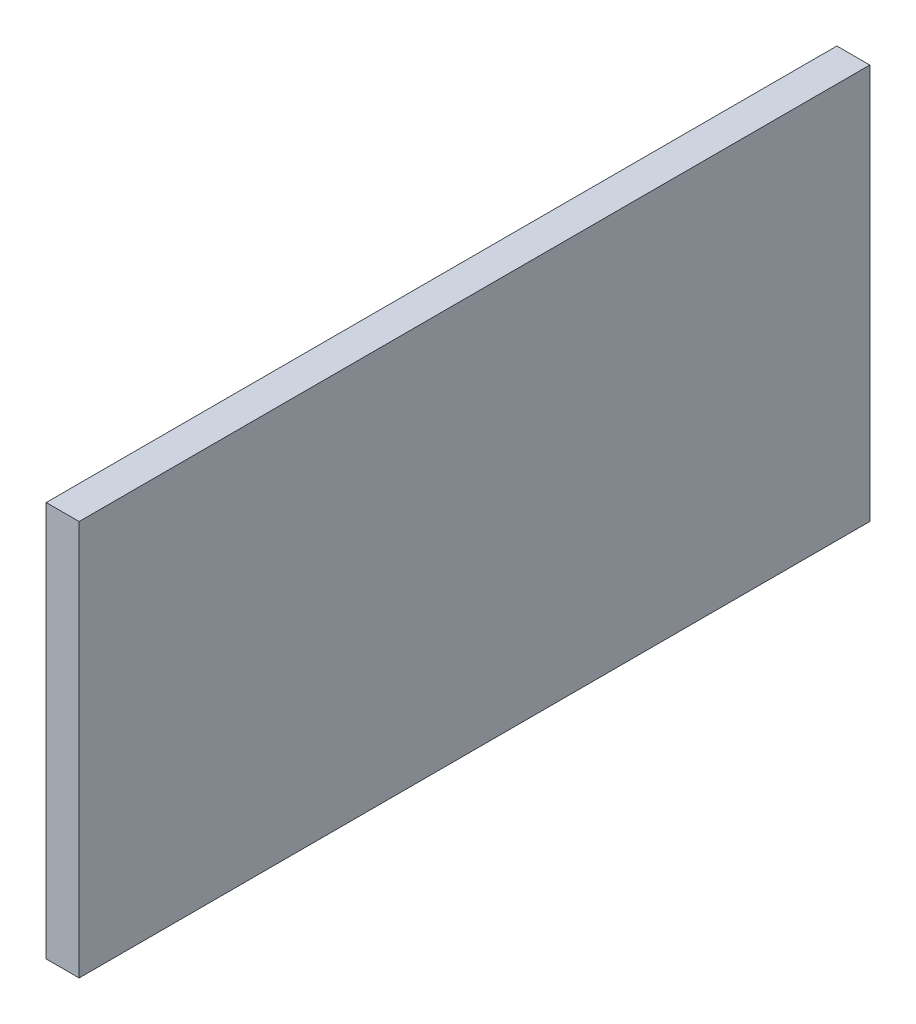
ISO-10303-21;
HEADER;
FILE_DESCRIPTION(('STEP AP214'),'2;1');
FILE_NAME('part.step','',(''),(''),'','','');
FILE_SCHEMA(('AUTOMOTIVE_DESIGN { 1 0 10303 214 1 1 1 1 }'));
ENDSEC;
DATA;
#1=APPLICATION_CONTEXT('core data for automotive mechanical design processes');
#2=APPLICATION_PROTOCOL_DEFINITION('international standard','automotive_design',2000,#1);
#3=PRODUCT_CONTEXT('',#1,'mechanical');
#4=PRODUCT('Part','Part','',(#3));
#5=PRODUCT_RELATED_PRODUCT_CATEGORY('part','',(#4));
#6=PRODUCT_DEFINITION_FORMATION('','',#4);
#7=PRODUCT_DEFINITION_CONTEXT('part definition',#1,'design');
#8=PRODUCT_DEFINITION('design','',#6,#7);
#9=PRODUCT_DEFINITION_SHAPE('','',#8);
#10=(LENGTH_UNIT() NAMED_UNIT(*) SI_UNIT(.MILLI.,.METRE.));
#11=(NAMED_UNIT(*) PLANE_ANGLE_UNIT() SI_UNIT($,.RADIAN.));
#12=(NAMED_UNIT(*) SI_UNIT($,.STERADIAN.) SOLID_ANGLE_UNIT());
#13=UNCERTAINTY_MEASURE_WITH_UNIT(LENGTH_MEASURE(1.E-05),#10,'distance_accuracy_value','');
#14=(GEOMETRIC_REPRESENTATION_CONTEXT(3) GLOBAL_UNCERTAINTY_ASSIGNED_CONTEXT((#13)) GLOBAL_UNIT_ASSIGNED_CONTEXT((#10,
#11,#12)) REPRESENTATION_CONTEXT('',''));
#15=CARTESIAN_POINT('',(0.,0.,0.));
#16=DIRECTION('',(0.,0.,1.));
#17=DIRECTION('',(1.,0.,0.));
#18=AXIS2_PLACEMENT_3D('',#15,#16,#17);
#19=CARTESIAN_POINT('',(0.,609.6,-1117.6));
#20=DIRECTION('',(1.,0.,0.));
#21=DIRECTION('',(0.,0.,-1.));
#22=AXIS2_PLACEMENT_3D('',#19,#20,#21);
#23=PLANE('',#22);
#24=DIRECTION('',(0.,0.,1.));
#25=VECTOR('',#24,1.);
#26=CARTESIAN_POINT('',(0.,193.04,-393.585401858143));
#27=LINE('',#26,#25);
#28=CARTESIAN_POINT('',(0.,193.04,-393.585401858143));
#29=VERTEX_POINT('',#28);
#30=CARTESIAN_POINT('',(0.,193.04,-317.385401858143));
#31=VERTEX_POINT('',#30);
#32=EDGE_CURVE('E156',#29,#31,#27,.T.);
#33=ORIENTED_EDGE('',*,*,#32,.F.);
#34=DIRECTION('',(0.,-1.,0.));
#35=VECTOR('',#34,1.);
#36=CARTESIAN_POINT('',(0.,266.7,-393.585401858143));
#37=LINE('',#36,#35);
#38=CARTESIAN_POINT('',(0.,266.7,-393.585401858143));
#39=VERTEX_POINT('',#38);
#40=EDGE_CURVE('E46',#39,#29,#37,.T.);
#41=ORIENTED_EDGE('',*,*,#40,.F.);
#42=DIRECTION('',(0.,0.,-1.));
#43=VECTOR('',#42,1.);
#44=CARTESIAN_POINT('',(0.,266.7,-393.585401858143));
#45=LINE('',#44,#43);
#46=CARTESIAN_POINT('',(0.,266.7,-317.385401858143));
#47=VERTEX_POINT('',#46);
#48=EDGE_CURVE('E147',#47,#39,#45,.T.);
#49=ORIENTED_EDGE('',*,*,#48,.F.);
#50=DIRECTION('',(0.,1.,0.));
#51=VECTOR('',#50,1.);
#52=CARTESIAN_POINT('',(0.,266.7,-317.385401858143));
#53=LINE('',#52,#51);
#54=EDGE_CURVE('E150',#31,#47,#53,.T.);
#55=ORIENTED_EDGE('',*,*,#54,.F.);
#56=EDGE_LOOP('',(#33,#41,#49,#55));
#57=FACE_BOUND('',#56,.T.);
#58=DIRECTION('',(0.,-1.,0.));
#59=VECTOR('',#58,1.);
#60=CARTESIAN_POINT('',(0.,609.6,0.));
#61=LINE('',#60,#59);
#62=CARTESIAN_POINT('',(0.,533.4,0.));
#63=VERTEX_POINT('',#62);
#64=CARTESIAN_POINT('',(0.,0.,0.));
#65=VERTEX_POINT('',#64);
#66=EDGE_CURVE('E11',#63,#65,#61,.T.);
#67=ORIENTED_EDGE('',*,*,#66,.F.);
#68=DIRECTION('',(0.,0.,1.));
#69=VECTOR('',#68,1.);
#70=CARTESIAN_POINT('',(0.,533.4,-1168.401));
#71=LINE('',#70,#69);
#72=CARTESIAN_POINT('',(0.,533.4,-1117.6));
#73=VERTEX_POINT('',#72);
#74=EDGE_CURVE('E168',#73,#63,#71,.T.);
#75=ORIENTED_EDGE('',*,*,#74,.F.);
#76=DIRECTION('',(0.,-1.,0.));
#77=VECTOR('',#76,1.);
#78=CARTESIAN_POINT('',(0.,609.6,-1117.6));
#79=LINE('',#78,#77);
#80=CARTESIAN_POINT('',(0.,0.,-1117.6));
#81=VERTEX_POINT('',#80);
#82=EDGE_CURVE('E89',#73,#81,#79,.T.);
#83=ORIENTED_EDGE('',*,*,#82,.T.);
#84=DIRECTION('',(0.,0.,1.));
#85=VECTOR('',#84,1.);
#86=CARTESIAN_POINT('',(0.,0.,-1117.6));
#87=LINE('',#86,#85);
#88=EDGE_CURVE('E174',#81,#65,#87,.T.);
#89=ORIENTED_EDGE('',*,*,#88,.T.);
#90=EDGE_LOOP('',(#67,#75,#83,#89));
#91=FACE_BOUND('',#90,.T.);
#92=ADVANCED_FACE('F32',(#57,#91),#23,.F.);
#93=CARTESIAN_POINT('',(0.,609.6,0.));
#94=DIRECTION('',(0.,0.,-1.));
#95=DIRECTION('',(-1.,0.,0.));
#96=AXIS2_PLACEMENT_3D('',#93,#94,#95);
#97=PLANE('',#96);
#98=DIRECTION('',(0.,-1.,0.));
#99=VECTOR('',#98,1.);
#100=CARTESIAN_POINT('',(50.8,609.6,0.));
#101=LINE('',#100,#99);
#102=CARTESIAN_POINT('',(50.8,533.4,0.));
#103=VERTEX_POINT('',#102);
#104=CARTESIAN_POINT('',(50.8,0.,0.));
#105=VERTEX_POINT('',#104);
#106=EDGE_CURVE('E39',#103,#105,#101,.T.);
#107=ORIENTED_EDGE('',*,*,#106,.F.);
#108=DIRECTION('',(1.,0.,0.));
#109=VECTOR('',#108,1.);
#110=CARTESIAN_POINT('',(0.,533.4,0.));
#111=LINE('',#110,#109);
#112=EDGE_CURVE('E162',#63,#103,#111,.T.);
#113=ORIENTED_EDGE('',*,*,#112,.F.);
#114=ORIENTED_EDGE('',*,*,#66,.T.);
#115=DIRECTION('',(1.,0.,0.));
#116=VECTOR('',#115,1.);
#117=CARTESIAN_POINT('',(0.,0.,0.));
#118=LINE('',#117,#116);
#119=EDGE_CURVE('E184',#65,#105,#118,.T.);
#120=ORIENTED_EDGE('',*,*,#119,.T.);
#121=EDGE_LOOP('',(#107,#113,#114,#120));
#122=FACE_BOUND('',#121,.T.);
#123=ADVANCED_FACE('F219',(#122),#97,.F.);
#124=CARTESIAN_POINT('',(50.8,609.6,50.8));
#125=DIRECTION('',(0.,0.,-1.));
#126=DIRECTION('',(-1.,0.,0.));
#127=AXIS2_PLACEMENT_3D('',#124,#125,#126);
#128=PLANE('',#127);
#129=DIRECTION('',(1.,0.,0.));
#130=VECTOR('',#129,1.);
#131=CARTESIAN_POINT('',(50.8,0.,50.8));
#132=LINE('',#131,#130);
#133=CARTESIAN_POINT('',(50.8,0.,50.8));
#134=VERTEX_POINT('',#133);
#135=CARTESIAN_POINT('',(101.6,0.,50.8));
#136=VERTEX_POINT('',#135);
#137=EDGE_CURVE('E189',#134,#136,#132,.T.);
#138=ORIENTED_EDGE('',*,*,#137,.T.);
#139=DIRECTION('',(0.,-1.,0.));
#140=VECTOR('',#139,1.);
#141=CARTESIAN_POINT('',(101.6,609.6,50.8));
#142=LINE('',#141,#140);
#143=CARTESIAN_POINT('',(101.6,609.6,50.8));
#144=VERTEX_POINT('',#143);
#145=EDGE_CURVE('E207',#144,#136,#142,.T.);
#146=ORIENTED_EDGE('',*,*,#145,.F.);
#147=DIRECTION('',(1.,0.,0.));
#148=VECTOR('',#147,1.);
#149=CARTESIAN_POINT('',(50.8,609.6,50.8));
#150=LINE('',#149,#148);
#151=CARTESIAN_POINT('',(50.8,609.6,50.8));
#152=VERTEX_POINT('',#151);
#153=EDGE_CURVE('E176',#152,#144,#150,.T.);
#154=ORIENTED_EDGE('',*,*,#153,.F.);
#155=DIRECTION('',(0.,-1.,0.));
#156=VECTOR('',#155,1.);
#157=CARTESIAN_POINT('',(50.8,609.6,50.8));
#158=LINE('',#157,#156);
#159=EDGE_CURVE('E210',#152,#134,#158,.T.);
#160=ORIENTED_EDGE('',*,*,#159,.T.);
#161=EDGE_LOOP('',(#138,#146,#154,#160));
#162=FACE_BOUND('',#161,.T.);
#163=ADVANCED_FACE('F229',(#162),#128,.F.);
#164=CARTESIAN_POINT('',(101.6,609.6,50.8));
#165=DIRECTION('',(-1.,0.,0.));
#166=DIRECTION('',(0.,0.,1.));
#167=AXIS2_PLACEMENT_3D('',#164,#165,#166);
#168=PLANE('',#167);
#169=DIRECTION('',(0.,0.,-1.));
#170=VECTOR('',#169,1.);
#171=CARTESIAN_POINT('',(101.6,0.,50.8));
#172=LINE('',#171,#170);
#173=CARTESIAN_POINT('',(101.6,0.,-1168.4));
#174=VERTEX_POINT('',#173);
#175=EDGE_CURVE('E191',#136,#174,#172,.T.);
#176=ORIENTED_EDGE('',*,*,#175,.T.);
#177=DIRECTION('',(0.,-1.,0.));
#178=VECTOR('',#177,1.);
#179=CARTESIAN_POINT('',(101.6,609.6,-1168.4));
#180=LINE('',#179,#178);
#181=CARTESIAN_POINT('',(101.6,609.6,-1168.4));
#182=VERTEX_POINT('',#181);
#183=EDGE_CURVE('E204',#182,#174,#180,.T.);
#184=ORIENTED_EDGE('',*,*,#183,.F.);
#185=DIRECTION('',(0.,0.,-1.));
#186=VECTOR('',#185,1.);
#187=CARTESIAN_POINT('',(101.6,609.6,50.8));
#188=LINE('',#187,#186);
#189=EDGE_CURVE('E179',#144,#182,#188,.T.);
#190=ORIENTED_EDGE('',*,*,#189,.F.);
#191=ORIENTED_EDGE('',*,*,#145,.T.);
#192=EDGE_LOOP('',(#176,#184,#190,#191));
#193=FACE_BOUND('',#192,.T.);
#194=ADVANCED_FACE('F233',(#193),#168,.F.);
#195=CARTESIAN_POINT('',(101.6,609.6,-1168.4));
#196=DIRECTION('',(0.,0.,1.));
#197=DIRECTION('',(1.,0.,0.));
#198=AXIS2_PLACEMENT_3D('',#195,#196,#197);
#199=PLANE('',#198);
#200=DIRECTION('',(-1.,0.,0.));
#201=VECTOR('',#200,1.);
#202=CARTESIAN_POINT('',(101.6,0.,-1168.4));
#203=LINE('',#202,#201);
#204=CARTESIAN_POINT('',(50.7999999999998,0.,-1168.4));
#205=VERTEX_POINT('',#204);
#206=EDGE_CURVE('E193',#174,#205,#203,.T.);
#207=ORIENTED_EDGE('',*,*,#206,.T.);
#208=DIRECTION('',(0.,-1.,0.));
#209=VECTOR('',#208,1.);
#210=CARTESIAN_POINT('',(50.7999999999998,609.6,-1168.4));
#211=LINE('',#210,#209);
#212=CARTESIAN_POINT('',(50.7999999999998,609.6,-1168.4));
#213=VERTEX_POINT('',#212);
#214=EDGE_CURVE('E202',#213,#205,#211,.T.);
#215=ORIENTED_EDGE('',*,*,#214,.F.);
#216=DIRECTION('',(-1.,0.,0.));
#217=VECTOR('',#216,1.);
#218=CARTESIAN_POINT('',(101.6,609.6,-1168.4));
#219=LINE('',#218,#217);
#220=EDGE_CURVE('E181',#182,#213,#219,.T.);
#221=ORIENTED_EDGE('',*,*,#220,.F.);
#222=ORIENTED_EDGE('',*,*,#183,.T.);
#223=EDGE_LOOP('',(#207,#215,#221,#222));
#224=FACE_BOUND('',#223,.T.);
#225=ADVANCED_FACE('F239',(#224),#199,.F.);
#226=CARTESIAN_POINT('',(50.7999999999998,609.6,-1168.4));
#227=DIRECTION('',(1.,0.,0.));
#228=DIRECTION('',(0.,0.,-1.));
#229=AXIS2_PLACEMENT_3D('',#226,#227,#228);
#230=PLANE('',#229);
#231=DIRECTION('',(0.,0.,1.));
#232=VECTOR('',#231,1.);
#233=CARTESIAN_POINT('',(50.7999999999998,0.,-1168.4));
#234=LINE('',#233,#232);
#235=CARTESIAN_POINT('',(50.7999999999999,0.,-1117.6));
#236=VERTEX_POINT('',#235);
#237=EDGE_CURVE('E195',#205,#236,#234,.T.);
#238=ORIENTED_EDGE('',*,*,#237,.T.);
#239=DIRECTION('',(0.,-1.,0.));
#240=VECTOR('',#239,1.);
#241=CARTESIAN_POINT('',(50.7999999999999,609.6,-1117.6));
#242=LINE('',#241,#240);
#243=CARTESIAN_POINT('',(50.8,533.4,-1117.6));
#244=VERTEX_POINT('',#243);
#245=EDGE_CURVE('E200',#244,#236,#242,.T.);
#246=ORIENTED_EDGE('',*,*,#245,.F.);
#247=DIRECTION('',(0.,0.,1.));
#248=VECTOR('',#247,1.);
#249=CARTESIAN_POINT('',(50.8,533.4,-1168.401));
#250=LINE('',#249,#248);
#251=EDGE_CURVE('E169',#244,#103,#250,.T.);
#252=ORIENTED_EDGE('',*,*,#251,.T.);
#253=ORIENTED_EDGE('',*,*,#106,.T.);
#254=DIRECTION('',(0.,0.,1.));
#255=VECTOR('',#254,1.);
#256=CARTESIAN_POINT('',(50.8,0.,0.));
#257=LINE('',#256,#255);
#258=EDGE_CURVE('E187',#105,#134,#257,.T.);
#259=ORIENTED_EDGE('',*,*,#258,.T.);
#260=ORIENTED_EDGE('',*,*,#159,.F.);
#261=DIRECTION('',(0.,0.,1.));
#262=VECTOR('',#261,1.);
#263=CARTESIAN_POINT('',(50.8,609.6,0.));
#264=LINE('',#263,#262);
#265=EDGE_CURVE('E55',#213,#152,#264,.T.);
#266=ORIENTED_EDGE('',*,*,#265,.F.);
#267=ORIENTED_EDGE('',*,*,#214,.T.);
#268=EDGE_LOOP('',(#238,#246,#252,#253,#259,#260,#266,#267));
#269=FACE_BOUND('',#268,.T.);
#270=ADVANCED_FACE('F213',(#269),#230,.F.);
#271=CARTESIAN_POINT('',(50.7999999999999,609.6,-1117.6));
#272=DIRECTION('',(0.,0.,1.));
#273=DIRECTION('',(1.,0.,0.));
#274=AXIS2_PLACEMENT_3D('',#271,#272,#273);
#275=PLANE('',#274);
#276=ORIENTED_EDGE('',*,*,#82,.F.);
#277=DIRECTION('',(-1.,0.,0.));
#278=VECTOR('',#277,1.);
#279=CARTESIAN_POINT('',(0.,533.4,-1117.6));
#280=LINE('',#279,#278);
#281=EDGE_CURVE('E171',#244,#73,#280,.T.);
#282=ORIENTED_EDGE('',*,*,#281,.F.);
#283=ORIENTED_EDGE('',*,*,#245,.T.);
#284=DIRECTION('',(-1.,0.,0.));
#285=VECTOR('',#284,1.);
#286=CARTESIAN_POINT('',(50.7999999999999,0.,-1117.6));
#287=LINE('',#286,#285);
#288=EDGE_CURVE('E177',#236,#81,#287,.T.);
#289=ORIENTED_EDGE('',*,*,#288,.T.);
#290=EDGE_LOOP('',(#276,#282,#283,#289));
#291=FACE_BOUND('',#290,.T.);
#292=ADVANCED_FACE('F243',(#291),#275,.F.);
#293=CARTESIAN_POINT('',(0.,609.6,0.));
#294=DIRECTION('',(0.,1.,0.));
#295=DIRECTION('',(0.,0.,1.));
#296=AXIS2_PLACEMENT_3D('',#293,#294,#295);
#297=PLANE('',#296);
#298=ORIENTED_EDGE('',*,*,#220,.T.);
#299=ORIENTED_EDGE('',*,*,#265,.T.);
#300=ORIENTED_EDGE('',*,*,#153,.T.);
#301=ORIENTED_EDGE('',*,*,#189,.T.);
#302=EDGE_LOOP('',(#298,#299,#300,#301));
#303=FACE_BOUND('',#302,.T.);
#304=ADVANCED_FACE('F236',(#303),#297,.T.);
#305=CARTESIAN_POINT('',(0.,0.,0.));
#306=DIRECTION('',(0.,1.,0.));
#307=DIRECTION('',(0.,0.,1.));
#308=AXIS2_PLACEMENT_3D('',#305,#306,#307);
#309=PLANE('',#308);
#310=ORIENTED_EDGE('',*,*,#88,.F.);
#311=ORIENTED_EDGE('',*,*,#288,.F.);
#312=ORIENTED_EDGE('',*,*,#237,.F.);
#313=ORIENTED_EDGE('',*,*,#206,.F.);
#314=ORIENTED_EDGE('',*,*,#175,.F.);
#315=ORIENTED_EDGE('',*,*,#137,.F.);
#316=ORIENTED_EDGE('',*,*,#258,.F.);
#317=ORIENTED_EDGE('',*,*,#119,.F.);
#318=EDGE_LOOP('',(#310,#311,#312,#313,#314,#315,#316,#317));
#319=FACE_BOUND('',#318,.T.);
#320=ADVANCED_FACE('F224',(#319),#309,.F.);
#321=CARTESIAN_POINT('',(0.,533.4,-1168.401));
#322=DIRECTION('',(0.,-1.,0.));
#323=DIRECTION('',(0.,0.,-1.));
#324=AXIS2_PLACEMENT_3D('',#321,#322,#323);
#325=PLANE('',#324);
#326=ORIENTED_EDGE('',*,*,#281,.T.);
#327=ORIENTED_EDGE('',*,*,#74,.T.);
#328=ORIENTED_EDGE('',*,*,#112,.T.);
#329=ORIENTED_EDGE('',*,*,#251,.F.);
#330=EDGE_LOOP('',(#326,#327,#328,#329));
#331=FACE_BOUND('',#330,.T.);
#332=ADVANCED_FACE('F246',(#331),#325,.F.);
#333=CARTESIAN_POINT('',(50.8,266.7,-393.585401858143));
#334=DIRECTION('',(0.,0.,-1.));
#335=DIRECTION('',(-1.,0.,0.));
#336=AXIS2_PLACEMENT_3D('',#333,#334,#335);
#337=PLANE('',#336);
#338=ORIENTED_EDGE('',*,*,#40,.T.);
#339=DIRECTION('',(-1.,0.,0.));
#340=VECTOR('',#339,1.);
#341=CARTESIAN_POINT('',(50.8,193.04,-393.585401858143));
#342=LINE('',#341,#340);
#343=CARTESIAN_POINT('',(50.8,193.04,-393.585401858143));
#344=VERTEX_POINT('',#343);
#345=EDGE_CURVE('E125',#344,#29,#342,.T.);
#346=ORIENTED_EDGE('',*,*,#345,.F.);
#347=DIRECTION('',(0.,-1.,0.));
#348=VECTOR('',#347,1.);
#349=CARTESIAN_POINT('',(50.8,266.7,-393.585401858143));
#350=LINE('',#349,#348);
#351=CARTESIAN_POINT('',(50.8,266.7,-393.585401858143));
#352=VERTEX_POINT('',#351);
#353=EDGE_CURVE('E129',#352,#344,#350,.T.);
#354=ORIENTED_EDGE('',*,*,#353,.F.);
#355=DIRECTION('',(-1.,0.,0.));
#356=VECTOR('',#355,1.);
#357=CARTESIAN_POINT('',(50.8,266.7,-393.585401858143));
#358=LINE('',#357,#356);
#359=EDGE_CURVE('E160',#352,#39,#358,.T.);
#360=ORIENTED_EDGE('',*,*,#359,.T.);
#361=EDGE_LOOP('',(#338,#346,#354,#360));
#362=FACE_BOUND('',#361,.T.);
#363=ADVANCED_FACE('F127',(#362),#337,.F.);
#364=CARTESIAN_POINT('',(50.8,266.7,-393.585401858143));
#365=DIRECTION('',(0.,1.,0.));
#366=DIRECTION('',(0.,0.,1.));
#367=AXIS2_PLACEMENT_3D('',#364,#365,#366);
#368=PLANE('',#367);
#369=ORIENTED_EDGE('',*,*,#48,.T.);
#370=ORIENTED_EDGE('',*,*,#359,.F.);
#371=DIRECTION('',(0.,0.,-1.));
#372=VECTOR('',#371,1.);
#373=CARTESIAN_POINT('',(50.8,266.7,-393.585401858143));
#374=LINE('',#373,#372);
#375=CARTESIAN_POINT('',(50.8,266.7,-317.385401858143));
#376=VERTEX_POINT('',#375);
#377=EDGE_CURVE('E135',#376,#352,#374,.T.);
#378=ORIENTED_EDGE('',*,*,#377,.F.);
#379=DIRECTION('',(-1.,0.,0.));
#380=VECTOR('',#379,1.);
#381=CARTESIAN_POINT('',(50.8,266.7,-317.385401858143));
#382=LINE('',#381,#380);
#383=EDGE_CURVE('E163',#376,#47,#382,.T.);
#384=ORIENTED_EDGE('',*,*,#383,.T.);
#385=EDGE_LOOP('',(#369,#370,#378,#384));
#386=FACE_BOUND('',#385,.T.);
#387=ADVANCED_FACE('F257',(#386),#368,.F.);
#388=CARTESIAN_POINT('',(50.8,266.7,-317.385401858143));
#389=DIRECTION('',(0.,0.,1.));
#390=DIRECTION('',(0.,-1.,0.));
#391=AXIS2_PLACEMENT_3D('',#388,#389,#390);
#392=PLANE('',#391);
#393=ORIENTED_EDGE('',*,*,#54,.T.);
#394=ORIENTED_EDGE('',*,*,#383,.F.);
#395=DIRECTION('',(0.,1.,0.));
#396=VECTOR('',#395,1.);
#397=CARTESIAN_POINT('',(50.8,266.7,-317.385401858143));
#398=LINE('',#397,#396);
#399=CARTESIAN_POINT('',(50.8,193.04,-317.385401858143));
#400=VERTEX_POINT('',#399);
#401=EDGE_CURVE('E143',#400,#376,#398,.T.);
#402=ORIENTED_EDGE('',*,*,#401,.F.);
#403=DIRECTION('',(-1.,0.,0.));
#404=VECTOR('',#403,1.);
#405=CARTESIAN_POINT('',(50.8,193.04,-317.385401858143));
#406=LINE('',#405,#404);
#407=EDGE_CURVE('E134',#400,#31,#406,.T.);
#408=ORIENTED_EDGE('',*,*,#407,.T.);
#409=EDGE_LOOP('',(#393,#394,#402,#408));
#410=FACE_BOUND('',#409,.T.);
#411=ADVANCED_FACE('F255',(#410),#392,.F.);
#412=CARTESIAN_POINT('',(50.8,193.04,-393.585401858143));
#413=DIRECTION('',(0.,-1.,0.));
#414=DIRECTION('',(0.,0.,-1.));
#415=AXIS2_PLACEMENT_3D('',#412,#413,#414);
#416=PLANE('',#415);
#417=ORIENTED_EDGE('',*,*,#32,.T.);
#418=ORIENTED_EDGE('',*,*,#407,.F.);
#419=DIRECTION('',(0.,0.,1.));
#420=VECTOR('',#419,1.);
#421=CARTESIAN_POINT('',(50.8,193.04,-393.585401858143));
#422=LINE('',#421,#420);
#423=EDGE_CURVE('E138',#344,#400,#422,.T.);
#424=ORIENTED_EDGE('',*,*,#423,.F.);
#425=ORIENTED_EDGE('',*,*,#345,.T.);
#426=EDGE_LOOP('',(#417,#418,#424,#425));
#427=FACE_BOUND('',#426,.T.);
#428=ADVANCED_FACE('F139',(#427),#416,.F.);
#429=CARTESIAN_POINT('',(50.8,0.,0.));
#430=DIRECTION('',(-1.,0.,0.));
#431=DIRECTION('',(0.,0.,1.));
#432=AXIS2_PLACEMENT_3D('',#429,#430,#431);
#433=PLANE('',#432);
#434=ORIENTED_EDGE('',*,*,#353,.T.);
#435=ORIENTED_EDGE('',*,*,#423,.T.);
#436=ORIENTED_EDGE('',*,*,#401,.T.);
#437=ORIENTED_EDGE('',*,*,#377,.T.);
#438=EDGE_LOOP('',(#434,#435,#436,#437));
#439=FACE_BOUND('',#438,.T.);
#440=ADVANCED_FACE('F145',(#439),#433,.T.);
#441=CLOSED_SHELL('',(#92,#123,#163,#194,#225,#270,#292,#304,#320,#332,#363,#387,#411,#428,#440));
#442=MANIFOLD_SOLID_BREP('B2',#441);
#443=ADVANCED_BREP_SHAPE_REPRESENTATION('',(#18,#442),#14);
#444=SHAPE_DEFINITION_REPRESENTATION(#9,#443);
ENDSEC;
END-ISO-10303-21;
